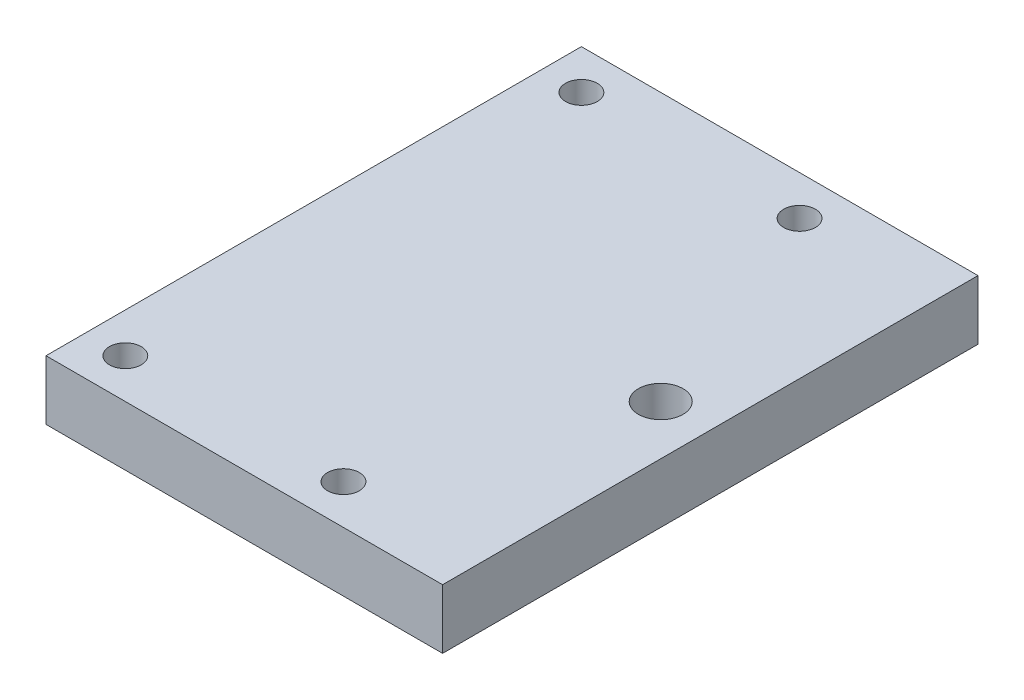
ISO-10303-21;
HEADER;
FILE_DESCRIPTION(('STEP AP214'),'2;1');
FILE_NAME('part.step','',(''),(''),'','','');
FILE_SCHEMA(('AUTOMOTIVE_DESIGN { 1 0 10303 214 1 1 1 1 }'));
ENDSEC;
DATA;
#1=APPLICATION_CONTEXT('core data for automotive mechanical design processes');
#2=APPLICATION_PROTOCOL_DEFINITION('international standard','automotive_design',2000,#1);
#3=PRODUCT_CONTEXT('',#1,'mechanical');
#4=PRODUCT('Part','Part','',(#3));
#5=PRODUCT_RELATED_PRODUCT_CATEGORY('part','',(#4));
#6=PRODUCT_DEFINITION_FORMATION('','',#4);
#7=PRODUCT_DEFINITION_CONTEXT('part definition',#1,'design');
#8=PRODUCT_DEFINITION('design','',#6,#7);
#9=PRODUCT_DEFINITION_SHAPE('','',#8);
#10=(LENGTH_UNIT() NAMED_UNIT(*) SI_UNIT(.MILLI.,.METRE.));
#11=(NAMED_UNIT(*) PLANE_ANGLE_UNIT() SI_UNIT($,.RADIAN.));
#12=(NAMED_UNIT(*) SI_UNIT($,.STERADIAN.) SOLID_ANGLE_UNIT());
#13=UNCERTAINTY_MEASURE_WITH_UNIT(LENGTH_MEASURE(1.E-05),#10,'distance_accuracy_value','');
#14=(GEOMETRIC_REPRESENTATION_CONTEXT(3) GLOBAL_UNCERTAINTY_ASSIGNED_CONTEXT((#13)) GLOBAL_UNIT_ASSIGNED_CONTEXT((#10,
#11,#12)) REPRESENTATION_CONTEXT('',''));
#15=CARTESIAN_POINT('',(0.,0.,0.));
#16=DIRECTION('',(0.,0.,1.));
#17=DIRECTION('',(1.,0.,0.));
#18=AXIS2_PLACEMENT_3D('',#15,#16,#17);
#19=CARTESIAN_POINT('',(0.,6.,-54.));
#20=DIRECTION('',(0.,-1.,0.));
#21=DIRECTION('',(0.,0.,-1.));
#22=AXIS2_PLACEMENT_3D('',#19,#20,#21);
#23=PLANE('',#22);
#24=CARTESIAN_POINT('',(35.,6.,-27.));
#25=DIRECTION('',(0.,1.,0.));
#26=DIRECTION('',(0.,0.,1.));
#27=AXIS2_PLACEMENT_3D('',#24,#25,#26);
#28=CIRCLE('',#27,2.25);
#29=CARTESIAN_POINT('',(35.,6.,-24.75));
#30=VERTEX_POINT('',#29);
#31=EDGE_CURVE('E92',#30,#30,#28,.T.);
#32=ORIENTED_EDGE('',*,*,#31,.F.);
#33=EDGE_LOOP('',(#32));
#34=FACE_BOUND('',#33,.T.);
#35=CARTESIAN_POINT('',(4.0005,6.,-4.0005));
#36=DIRECTION('',(0.,1.,0.));
#37=DIRECTION('',(0.,0.,1.));
#38=AXIS2_PLACEMENT_3D('',#35,#36,#37);
#39=CIRCLE('',#38,1.6002);
#40=CARTESIAN_POINT('',(4.0005,6.,-2.4003));
#41=VERTEX_POINT('',#40);
#42=EDGE_CURVE('E107',#41,#41,#39,.T.);
#43=ORIENTED_EDGE('',*,*,#42,.F.);
#44=EDGE_LOOP('',(#43));
#45=FACE_BOUND('',#44,.T.);
#46=CARTESIAN_POINT('',(4.0005,6.,-49.9999));
#47=DIRECTION('',(0.,1.,0.));
#48=DIRECTION('',(0.,0.,1.));
#49=AXIS2_PLACEMENT_3D('',#46,#47,#48);
#50=CIRCLE('',#49,1.6002);
#51=CARTESIAN_POINT('',(4.0005,6.,-48.3997));
#52=VERTEX_POINT('',#51);
#53=EDGE_CURVE('E119',#52,#52,#50,.T.);
#54=ORIENTED_EDGE('',*,*,#53,.F.);
#55=EDGE_LOOP('',(#54));
#56=FACE_BOUND('',#55,.T.);
#57=DIRECTION('',(0.,0.,1.));
#58=VECTOR('',#57,1.);
#59=CARTESIAN_POINT('',(0.,6.,0.));
#60=LINE('',#59,#58);
#61=CARTESIAN_POINT('',(0.,6.,-54.));
#62=VERTEX_POINT('',#61);
#63=CARTESIAN_POINT('',(0.,6.,0.));
#64=VERTEX_POINT('',#63);
#65=EDGE_CURVE('E124',#62,#64,#60,.T.);
#66=ORIENTED_EDGE('',*,*,#65,.T.);
#67=DIRECTION('',(1.,0.,0.));
#68=VECTOR('',#67,1.);
#69=CARTESIAN_POINT('',(0.,6.,0.));
#70=LINE('',#69,#68);
#71=CARTESIAN_POINT('',(40.,6.,0.));
#72=VERTEX_POINT('',#71);
#73=EDGE_CURVE('E49',#64,#72,#70,.T.);
#74=ORIENTED_EDGE('',*,*,#73,.T.);
#75=DIRECTION('',(0.,0.,1.));
#76=VECTOR('',#75,1.);
#77=CARTESIAN_POINT('',(40.,6.,0.));
#78=LINE('',#77,#76);
#79=CARTESIAN_POINT('',(40.,6.,-54.));
#80=VERTEX_POINT('',#79);
#81=EDGE_CURVE('E88',#80,#72,#78,.T.);
#82=ORIENTED_EDGE('',*,*,#81,.F.);
#83=DIRECTION('',(-1.,0.,0.));
#84=VECTOR('',#83,1.);
#85=CARTESIAN_POINT('',(0.,6.,-54.));
#86=LINE('',#85,#84);
#87=EDGE_CURVE('E42',#80,#62,#86,.T.);
#88=ORIENTED_EDGE('',*,*,#87,.T.);
#89=EDGE_LOOP('',(#66,#74,#82,#88));
#90=FACE_BOUND('',#89,.T.);
#91=CARTESIAN_POINT('',(25.99944,6.,-49.9999));
#92=DIRECTION('',(0.,1.,0.));
#93=DIRECTION('',(0.,0.,1.));
#94=AXIS2_PLACEMENT_3D('',#91,#92,#93);
#95=CIRCLE('',#94,1.6002);
#96=CARTESIAN_POINT('',(25.99944,6.,-48.3997));
#97=VERTEX_POINT('',#96);
#98=EDGE_CURVE('E113',#97,#97,#95,.T.);
#99=ORIENTED_EDGE('',*,*,#98,.F.);
#100=EDGE_LOOP('',(#99));
#101=FACE_BOUND('',#100,.T.);
#102=CARTESIAN_POINT('',(25.99944,6.,-4.0005));
#103=DIRECTION('',(0.,1.,0.));
#104=DIRECTION('',(0.,0.,1.));
#105=AXIS2_PLACEMENT_3D('',#102,#103,#104);
#106=CIRCLE('',#105,1.6002);
#107=CARTESIAN_POINT('',(25.99944,6.,-2.4003));
#108=VERTEX_POINT('',#107);
#109=EDGE_CURVE('E101',#108,#108,#106,.T.);
#110=ORIENTED_EDGE('',*,*,#109,.F.);
#111=EDGE_LOOP('',(#110));
#112=FACE_BOUND('',#111,.T.);
#113=ADVANCED_FACE('F27',(#34,#45,#56,#90,#101,#112),#23,.F.);
#114=CARTESIAN_POINT('',(0.,0.,-54.));
#115=DIRECTION('',(0.,-1.,0.));
#116=DIRECTION('',(0.,0.,-1.));
#117=AXIS2_PLACEMENT_3D('',#114,#115,#116);
#118=PLANE('',#117);
#119=CARTESIAN_POINT('',(35.,0.,-27.));
#120=DIRECTION('',(0.,1.,0.));
#121=DIRECTION('',(0.,0.,1.));
#122=AXIS2_PLACEMENT_3D('',#119,#120,#121);
#123=CIRCLE('',#122,2.25);
#124=CARTESIAN_POINT('',(35.,0.,-24.75));
#125=VERTEX_POINT('',#124);
#126=EDGE_CURVE('E89',#125,#125,#123,.T.);
#127=ORIENTED_EDGE('',*,*,#126,.T.);
#128=EDGE_LOOP('',(#127));
#129=FACE_BOUND('',#128,.T.);
#130=CARTESIAN_POINT('',(4.0005,0.,-4.0005));
#131=DIRECTION('',(0.,1.,0.));
#132=DIRECTION('',(0.,0.,1.));
#133=AXIS2_PLACEMENT_3D('',#130,#131,#132);
#134=CIRCLE('',#133,1.6002);
#135=CARTESIAN_POINT('',(4.0005,0.,-2.4003));
#136=VERTEX_POINT('',#135);
#137=EDGE_CURVE('E104',#136,#136,#134,.T.);
#138=ORIENTED_EDGE('',*,*,#137,.T.);
#139=EDGE_LOOP('',(#138));
#140=FACE_BOUND('',#139,.T.);
#141=CARTESIAN_POINT('',(4.0005,0.,-49.9999));
#142=DIRECTION('',(0.,1.,0.));
#143=DIRECTION('',(0.,0.,1.));
#144=AXIS2_PLACEMENT_3D('',#141,#142,#143);
#145=CIRCLE('',#144,1.6002);
#146=CARTESIAN_POINT('',(4.0005,0.,-48.3997));
#147=VERTEX_POINT('',#146);
#148=EDGE_CURVE('E116',#147,#147,#145,.T.);
#149=ORIENTED_EDGE('',*,*,#148,.T.);
#150=EDGE_LOOP('',(#149));
#151=FACE_BOUND('',#150,.T.);
#152=DIRECTION('',(0.,0.,1.));
#153=VECTOR('',#152,1.);
#154=CARTESIAN_POINT('',(0.,0.,0.));
#155=LINE('',#154,#153);
#156=CARTESIAN_POINT('',(0.,0.,-54.));
#157=VERTEX_POINT('',#156);
#158=CARTESIAN_POINT('',(0.,0.,0.));
#159=VERTEX_POINT('',#158);
#160=EDGE_CURVE('E75',#157,#159,#155,.T.);
#161=ORIENTED_EDGE('',*,*,#160,.F.);
#162=DIRECTION('',(-1.,0.,0.));
#163=VECTOR('',#162,1.);
#164=CARTESIAN_POINT('',(0.,0.,-54.));
#165=LINE('',#164,#163);
#166=CARTESIAN_POINT('',(40.,0.,-54.));
#167=VERTEX_POINT('',#166);
#168=EDGE_CURVE('E74',#167,#157,#165,.T.);
#169=ORIENTED_EDGE('',*,*,#168,.F.);
#170=DIRECTION('',(0.,0.,-1.));
#171=VECTOR('',#170,1.);
#172=CARTESIAN_POINT('',(40.,0.,0.));
#173=LINE('',#172,#171);
#174=CARTESIAN_POINT('',(40.,0.,0.));
#175=VERTEX_POINT('',#174);
#176=EDGE_CURVE('E78',#175,#167,#173,.T.);
#177=ORIENTED_EDGE('',*,*,#176,.F.);
#178=DIRECTION('',(1.,0.,0.));
#179=VECTOR('',#178,1.);
#180=CARTESIAN_POINT('',(0.,0.,0.));
#181=LINE('',#180,#179);
#182=EDGE_CURVE('E65',#159,#175,#181,.T.);
#183=ORIENTED_EDGE('',*,*,#182,.F.);
#184=EDGE_LOOP('',(#161,#169,#177,#183));
#185=FACE_BOUND('',#184,.T.);
#186=CARTESIAN_POINT('',(25.99944,0.,-49.9999));
#187=DIRECTION('',(0.,1.,0.));
#188=DIRECTION('',(0.,0.,1.));
#189=AXIS2_PLACEMENT_3D('',#186,#187,#188);
#190=CIRCLE('',#189,1.6002);
#191=CARTESIAN_POINT('',(25.99944,0.,-48.3997));
#192=VERTEX_POINT('',#191);
#193=EDGE_CURVE('E110',#192,#192,#190,.T.);
#194=ORIENTED_EDGE('',*,*,#193,.T.);
#195=EDGE_LOOP('',(#194));
#196=FACE_BOUND('',#195,.T.);
#197=CARTESIAN_POINT('',(25.99944,0.,-4.0005));
#198=DIRECTION('',(0.,1.,0.));
#199=DIRECTION('',(0.,0.,1.));
#200=AXIS2_PLACEMENT_3D('',#197,#198,#199);
#201=CIRCLE('',#200,1.6002);
#202=CARTESIAN_POINT('',(25.99944,0.,-2.4003));
#203=VERTEX_POINT('',#202);
#204=EDGE_CURVE('E98',#203,#203,#201,.T.);
#205=ORIENTED_EDGE('',*,*,#204,.T.);
#206=EDGE_LOOP('',(#205));
#207=FACE_BOUND('',#206,.T.);
#208=ADVANCED_FACE('F79',(#129,#140,#151,#185,#196,#207),#118,.T.);
#209=CARTESIAN_POINT('',(0.,6.,0.));
#210=DIRECTION('',(1.,0.,0.));
#211=DIRECTION('',(0.,0.,-1.));
#212=AXIS2_PLACEMENT_3D('',#209,#210,#211);
#213=PLANE('',#212);
#214=ORIENTED_EDGE('',*,*,#160,.T.);
#215=DIRECTION('',(0.,-1.,0.));
#216=VECTOR('',#215,1.);
#217=CARTESIAN_POINT('',(0.,6.,0.));
#218=LINE('',#217,#216);
#219=EDGE_CURVE('E11',#64,#159,#218,.T.);
#220=ORIENTED_EDGE('',*,*,#219,.F.);
#221=ORIENTED_EDGE('',*,*,#65,.F.);
#222=DIRECTION('',(0.,-1.,0.));
#223=VECTOR('',#222,1.);
#224=CARTESIAN_POINT('',(0.,6.,-54.));
#225=LINE('',#224,#223);
#226=EDGE_CURVE('E35',#62,#157,#225,.T.);
#227=ORIENTED_EDGE('',*,*,#226,.T.);
#228=EDGE_LOOP('',(#214,#220,#221,#227));
#229=FACE_BOUND('',#228,.T.);
#230=ADVANCED_FACE('F29',(#229),#213,.F.);
#231=CARTESIAN_POINT('',(0.,6.,0.));
#232=DIRECTION('',(0.,0.,-1.));
#233=DIRECTION('',(-1.,0.,0.));
#234=AXIS2_PLACEMENT_3D('',#231,#232,#233);
#235=PLANE('',#234);
#236=ORIENTED_EDGE('',*,*,#182,.T.);
#237=DIRECTION('',(0.,-1.,0.));
#238=VECTOR('',#237,1.);
#239=CARTESIAN_POINT('',(40.,0.,0.));
#240=LINE('',#239,#238);
#241=EDGE_CURVE('E69',#72,#175,#240,.T.);
#242=ORIENTED_EDGE('',*,*,#241,.F.);
#243=ORIENTED_EDGE('',*,*,#73,.F.);
#244=ORIENTED_EDGE('',*,*,#219,.T.);
#245=EDGE_LOOP('',(#236,#242,#243,#244));
#246=FACE_BOUND('',#245,.T.);
#247=ADVANCED_FACE('F67',(#246),#235,.F.);
#248=CARTESIAN_POINT('',(0.,6.,-54.));
#249=DIRECTION('',(0.,0.,1.));
#250=DIRECTION('',(1.,0.,0.));
#251=AXIS2_PLACEMENT_3D('',#248,#249,#250);
#252=PLANE('',#251);
#253=ORIENTED_EDGE('',*,*,#168,.T.);
#254=ORIENTED_EDGE('',*,*,#226,.F.);
#255=ORIENTED_EDGE('',*,*,#87,.F.);
#256=DIRECTION('',(0.,1.,0.));
#257=VECTOR('',#256,1.);
#258=CARTESIAN_POINT('',(40.,0.,-54.));
#259=LINE('',#258,#257);
#260=EDGE_CURVE('E84',#167,#80,#259,.T.);
#261=ORIENTED_EDGE('',*,*,#260,.F.);
#262=EDGE_LOOP('',(#253,#254,#255,#261));
#263=FACE_BOUND('',#262,.T.);
#264=ADVANCED_FACE('F131',(#263),#252,.F.);
#265=CARTESIAN_POINT('',(4.0005,6.,-49.9999));
#266=DIRECTION('',(0.,-1.,0.));
#267=DIRECTION('',(0.,0.,-1.));
#268=AXIS2_PLACEMENT_3D('',#265,#266,#267);
#269=CYLINDRICAL_SURFACE('',#268,1.6002);
#270=ORIENTED_EDGE('',*,*,#53,.T.);
#271=EDGE_LOOP('',(#270));
#272=FACE_BOUND('',#271,.T.);
#273=ORIENTED_EDGE('',*,*,#148,.F.);
#274=EDGE_LOOP('',(#273));
#275=FACE_BOUND('',#274,.T.);
#276=ADVANCED_FACE('F156',(#272,#275),#269,.F.);
#277=CARTESIAN_POINT('',(25.99944,6.,-49.9999));
#278=DIRECTION('',(0.,-1.,0.));
#279=DIRECTION('',(0.,0.,-1.));
#280=AXIS2_PLACEMENT_3D('',#277,#278,#279);
#281=CYLINDRICAL_SURFACE('',#280,1.6002);
#282=ORIENTED_EDGE('',*,*,#98,.T.);
#283=EDGE_LOOP('',(#282));
#284=FACE_BOUND('',#283,.T.);
#285=ORIENTED_EDGE('',*,*,#193,.F.);
#286=EDGE_LOOP('',(#285));
#287=FACE_BOUND('',#286,.T.);
#288=ADVANCED_FACE('F210',(#284,#287),#281,.F.);
#289=CARTESIAN_POINT('',(4.0005,6.,-4.0005));
#290=DIRECTION('',(0.,-1.,0.));
#291=DIRECTION('',(0.,0.,-1.));
#292=AXIS2_PLACEMENT_3D('',#289,#290,#291);
#293=CYLINDRICAL_SURFACE('',#292,1.6002);
#294=ORIENTED_EDGE('',*,*,#42,.T.);
#295=EDGE_LOOP('',(#294));
#296=FACE_BOUND('',#295,.T.);
#297=ORIENTED_EDGE('',*,*,#137,.F.);
#298=EDGE_LOOP('',(#297));
#299=FACE_BOUND('',#298,.T.);
#300=ADVANCED_FACE('F143',(#296,#299),#293,.F.);
#301=CARTESIAN_POINT('',(25.99944,6.,-4.0005));
#302=DIRECTION('',(0.,-1.,0.));
#303=DIRECTION('',(0.,0.,-1.));
#304=AXIS2_PLACEMENT_3D('',#301,#302,#303);
#305=CYLINDRICAL_SURFACE('',#304,1.6002);
#306=ORIENTED_EDGE('',*,*,#109,.T.);
#307=EDGE_LOOP('',(#306));
#308=FACE_BOUND('',#307,.T.);
#309=ORIENTED_EDGE('',*,*,#204,.F.);
#310=EDGE_LOOP('',(#309));
#311=FACE_BOUND('',#310,.T.);
#312=ADVANCED_FACE('F140',(#308,#311),#305,.F.);
#313=CARTESIAN_POINT('',(40.,6.,0.));
#314=DIRECTION('',(-1.,0.,0.));
#315=DIRECTION('',(0.,0.,1.));
#316=AXIS2_PLACEMENT_3D('',#313,#314,#315);
#317=PLANE('',#316);
#318=ORIENTED_EDGE('',*,*,#241,.T.);
#319=ORIENTED_EDGE('',*,*,#176,.T.);
#320=ORIENTED_EDGE('',*,*,#260,.T.);
#321=ORIENTED_EDGE('',*,*,#81,.T.);
#322=EDGE_LOOP('',(#318,#319,#320,#321));
#323=FACE_BOUND('',#322,.T.);
#324=ADVANCED_FACE('F87',(#323),#317,.F.);
#325=CARTESIAN_POINT('',(35.,0.,-27.));
#326=DIRECTION('',(0.,1.,0.));
#327=DIRECTION('',(0.,0.,1.));
#328=AXIS2_PLACEMENT_3D('',#325,#326,#327);
#329=CYLINDRICAL_SURFACE('',#328,2.25);
#330=ORIENTED_EDGE('',*,*,#126,.F.);
#331=EDGE_LOOP('',(#330));
#332=FACE_BOUND('',#331,.T.);
#333=ORIENTED_EDGE('',*,*,#31,.T.);
#334=EDGE_LOOP('',(#333));
#335=FACE_BOUND('',#334,.T.);
#336=ADVANCED_FACE('F177',(#332,#335),#329,.F.);
#337=CLOSED_SHELL('',(#113,#208,#230,#247,#264,#276,#288,#300,#312,#324,#336));
#338=MANIFOLD_SOLID_BREP('B2',#337);
#339=ADVANCED_BREP_SHAPE_REPRESENTATION('',(#18,#338),#14);
#340=SHAPE_DEFINITION_REPRESENTATION(#9,#339);
ENDSEC;
END-ISO-10303-21;
